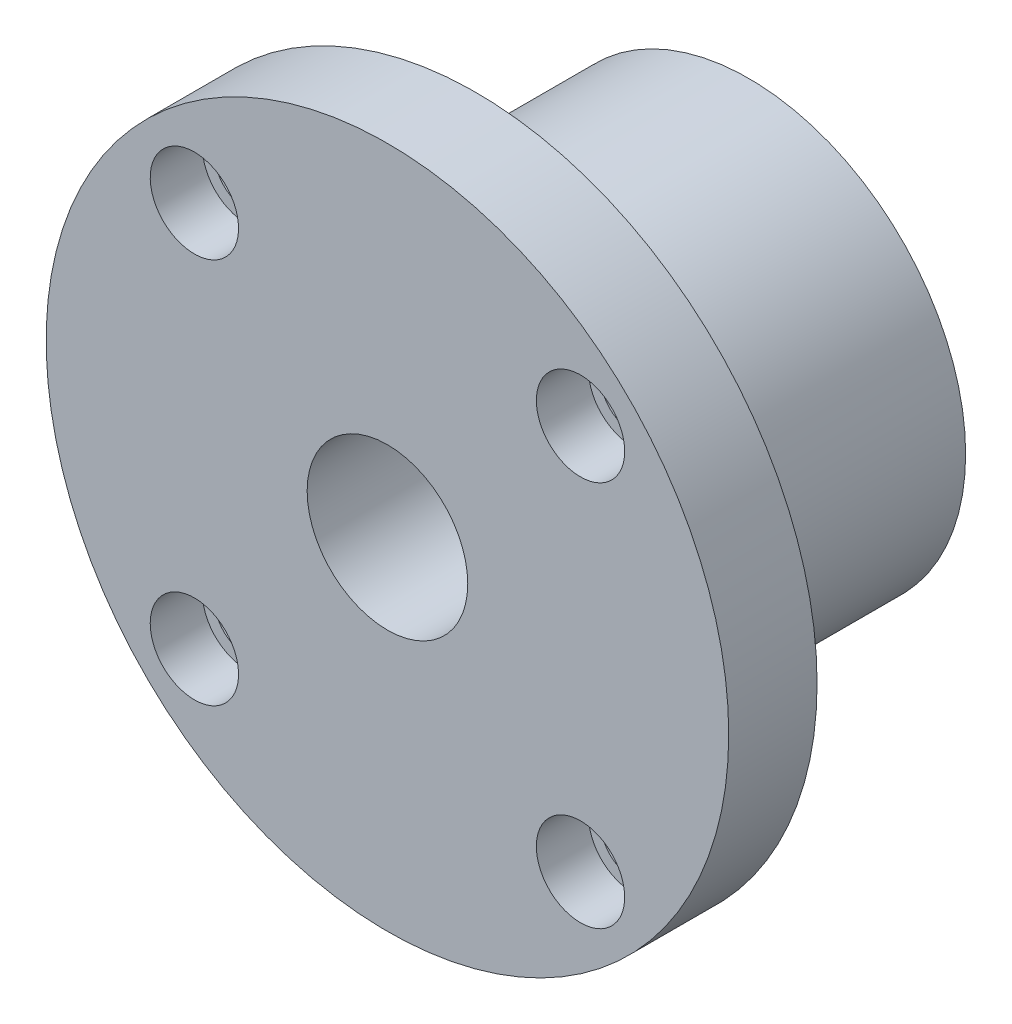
ISO-10303-21;
HEADER;
FILE_DESCRIPTION(('STEP AP214'),'2;1');
FILE_NAME('part.step','',(''),(''),'','','');
FILE_SCHEMA(('AUTOMOTIVE_DESIGN { 1 0 10303 214 1 1 1 1 }'));
ENDSEC;
DATA;
#1=APPLICATION_CONTEXT('core data for automotive mechanical design processes');
#2=APPLICATION_PROTOCOL_DEFINITION('international standard','automotive_design',2000,#1);
#3=PRODUCT_CONTEXT('',#1,'mechanical');
#4=PRODUCT('Part','Part','',(#3));
#5=PRODUCT_RELATED_PRODUCT_CATEGORY('part','',(#4));
#6=PRODUCT_DEFINITION_FORMATION('','',#4);
#7=PRODUCT_DEFINITION_CONTEXT('part definition',#1,'design');
#8=PRODUCT_DEFINITION('design','',#6,#7);
#9=PRODUCT_DEFINITION_SHAPE('','',#8);
#10=(LENGTH_UNIT() NAMED_UNIT(*) SI_UNIT(.MILLI.,.METRE.));
#11=(NAMED_UNIT(*) PLANE_ANGLE_UNIT() SI_UNIT($,.RADIAN.));
#12=(NAMED_UNIT(*) SI_UNIT($,.STERADIAN.) SOLID_ANGLE_UNIT());
#13=UNCERTAINTY_MEASURE_WITH_UNIT(LENGTH_MEASURE(1.E-05),#10,'distance_accuracy_value','');
#14=(GEOMETRIC_REPRESENTATION_CONTEXT(3) GLOBAL_UNCERTAINTY_ASSIGNED_CONTEXT((#13)) GLOBAL_UNIT_ASSIGNED_CONTEXT((#10,
#11,#12)) REPRESENTATION_CONTEXT('',''));
#15=CARTESIAN_POINT('',(0.,0.,0.));
#16=DIRECTION('',(0.,0.,1.));
#17=DIRECTION('',(1.,0.,0.));
#18=AXIS2_PLACEMENT_3D('',#15,#16,#17);
#19=CARTESIAN_POINT('',(0.,0.,0.));
#20=DIRECTION('',(0.,0.,1.));
#21=DIRECTION('',(1.,0.,0.));
#22=AXIS2_PLACEMENT_3D('',#19,#20,#21);
#23=PLANE('',#22);
#24=CARTESIAN_POINT('',(0.,0.,0.));
#25=DIRECTION('',(0.,0.,1.));
#26=DIRECTION('',(1.,0.,0.));
#27=AXIS2_PLACEMENT_3D('',#24,#25,#26);
#28=CIRCLE('',#27,42.5);
#29=CARTESIAN_POINT('',(42.5,0.,0.));
#30=VERTEX_POINT('',#29);
#31=EDGE_CURVE('E23',#30,#30,#28,.T.);
#32=ORIENTED_EDGE('',*,*,#31,.F.);
#33=EDGE_LOOP('',(#32));
#34=FACE_BOUND('',#33,.T.);
#35=CARTESIAN_POINT('',(24.0416305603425,24.0416305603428,0.));
#36=DIRECTION('',(0.,0.,1.));
#37=DIRECTION('',(1.,0.,0.));
#38=AXIS2_PLACEMENT_3D('',#35,#36,#37);
#39=CIRCLE('',#38,4.);
#40=CARTESIAN_POINT('',(28.0416305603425,24.0416305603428,0.));
#41=VERTEX_POINT('',#40);
#42=EDGE_CURVE('E35',#41,#41,#39,.T.);
#43=ORIENTED_EDGE('',*,*,#42,.T.);
#44=EDGE_LOOP('',(#43));
#45=FACE_BOUND('',#44,.T.);
#46=CARTESIAN_POINT('',(24.0416305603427,-24.0416305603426,0.));
#47=DIRECTION('',(0.,0.,1.));
#48=DIRECTION('',(0.,-1.,0.));
#49=AXIS2_PLACEMENT_3D('',#46,#47,#48);
#50=CIRCLE('',#49,4.);
#51=CARTESIAN_POINT('',(24.0416305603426,-28.0416305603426,0.));
#52=VERTEX_POINT('',#51);
#53=EDGE_CURVE('E75',#52,#52,#50,.T.);
#54=ORIENTED_EDGE('',*,*,#53,.T.);
#55=EDGE_LOOP('',(#54));
#56=FACE_BOUND('',#55,.T.);
#57=CARTESIAN_POINT('',(-24.0416305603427,-24.0416305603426,0.));
#58=DIRECTION('',(0.,0.,1.));
#59=DIRECTION('',(-1.,0.,0.));
#60=AXIS2_PLACEMENT_3D('',#57,#58,#59);
#61=CIRCLE('',#60,4.);
#62=CARTESIAN_POINT('',(-28.0416305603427,-24.0416305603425,0.));
#63=VERTEX_POINT('',#62);
#64=EDGE_CURVE('E72',#63,#63,#61,.T.);
#65=ORIENTED_EDGE('',*,*,#64,.T.);
#66=EDGE_LOOP('',(#65));
#67=FACE_BOUND('',#66,.T.);
#68=CARTESIAN_POINT('',(-24.0416305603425,24.0416305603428,0.));
#69=DIRECTION('',(0.,0.,1.));
#70=DIRECTION('',(0.,1.,0.));
#71=AXIS2_PLACEMENT_3D('',#68,#69,#70);
#72=CIRCLE('',#71,4.);
#73=CARTESIAN_POINT('',(-24.0416305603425,28.0416305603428,0.));
#74=VERTEX_POINT('',#73);
#75=EDGE_CURVE('E40',#74,#74,#72,.T.);
#76=ORIENTED_EDGE('',*,*,#75,.T.);
#77=EDGE_LOOP('',(#76));
#78=FACE_BOUND('',#77,.T.);
#79=CARTESIAN_POINT('',(0.,0.,0.));
#80=DIRECTION('',(0.,0.,1.));
#81=DIRECTION('',(1.,0.,0.));
#82=AXIS2_PLACEMENT_3D('',#79,#80,#81);
#83=CIRCLE('',#82,27.);
#84=CARTESIAN_POINT('',(27.,0.,0.));
#85=VERTEX_POINT('',#84);
#86=EDGE_CURVE('E8',#85,#85,#83,.F.);
#87=ORIENTED_EDGE('',*,*,#86,.F.);
#88=EDGE_LOOP('',(#87));
#89=FACE_BOUND('',#88,.T.);
#90=ADVANCED_FACE('F12',(#34,#45,#56,#67,#78,#89),#23,.F.);
#91=CARTESIAN_POINT('',(-24.0416305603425,24.0416305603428,0.));
#92=DIRECTION('',(0.,0.,1.));
#93=DIRECTION('',(1.,0.,0.));
#94=AXIS2_PLACEMENT_3D('',#91,#92,#93);
#95=CYLINDRICAL_SURFACE('',#94,4.);
#96=ORIENTED_EDGE('',*,*,#75,.F.);
#97=EDGE_LOOP('',(#96));
#98=FACE_BOUND('',#97,.T.);
#99=CARTESIAN_POINT('',(-24.0416305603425,24.0416305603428,4.5));
#100=DIRECTION('',(0.,0.,1.));
#101=DIRECTION('',(1.,0.,0.));
#102=AXIS2_PLACEMENT_3D('',#99,#100,#101);
#103=CIRCLE('',#102,4.);
#104=CARTESIAN_POINT('',(-20.0416305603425,24.0416305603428,4.5));
#105=VERTEX_POINT('',#104);
#106=EDGE_CURVE('E46',#105,#105,#103,.F.);
#107=ORIENTED_EDGE('',*,*,#106,.F.);
#108=EDGE_LOOP('',(#107));
#109=FACE_BOUND('',#108,.T.);
#110=ADVANCED_FACE('F120',(#98,#109),#95,.F.);
#111=CARTESIAN_POINT('',(-24.0416305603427,-24.0416305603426,0.));
#112=DIRECTION('',(0.,0.,1.));
#113=DIRECTION('',(1.,0.,0.));
#114=AXIS2_PLACEMENT_3D('',#111,#112,#113);
#115=CYLINDRICAL_SURFACE('',#114,4.);
#116=ORIENTED_EDGE('',*,*,#64,.F.);
#117=EDGE_LOOP('',(#116));
#118=FACE_BOUND('',#117,.T.);
#119=CARTESIAN_POINT('',(-24.0416305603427,-24.0416305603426,4.5));
#120=DIRECTION('',(0.,0.,1.));
#121=DIRECTION('',(1.,0.,0.));
#122=AXIS2_PLACEMENT_3D('',#119,#120,#121);
#123=CIRCLE('',#122,4.);
#124=CARTESIAN_POINT('',(-20.0416305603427,-24.0416305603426,4.5));
#125=VERTEX_POINT('',#124);
#126=EDGE_CURVE('E42',#125,#125,#123,.F.);
#127=ORIENTED_EDGE('',*,*,#126,.F.);
#128=EDGE_LOOP('',(#127));
#129=FACE_BOUND('',#128,.T.);
#130=ADVANCED_FACE('F126',(#118,#129),#115,.F.);
#131=CARTESIAN_POINT('',(24.0416305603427,-24.0416305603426,0.));
#132=DIRECTION('',(0.,0.,1.));
#133=DIRECTION('',(1.,0.,0.));
#134=AXIS2_PLACEMENT_3D('',#131,#132,#133);
#135=CYLINDRICAL_SURFACE('',#134,4.);
#136=ORIENTED_EDGE('',*,*,#53,.F.);
#137=EDGE_LOOP('',(#136));
#138=FACE_BOUND('',#137,.T.);
#139=CARTESIAN_POINT('',(24.0416305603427,-24.0416305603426,4.5));
#140=DIRECTION('',(0.,0.,1.));
#141=DIRECTION('',(1.,0.,0.));
#142=AXIS2_PLACEMENT_3D('',#139,#140,#141);
#143=CIRCLE('',#142,4.);
#144=CARTESIAN_POINT('',(28.0416305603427,-24.0416305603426,4.5));
#145=VERTEX_POINT('',#144);
#146=EDGE_CURVE('E37',#145,#145,#143,.F.);
#147=ORIENTED_EDGE('',*,*,#146,.F.);
#148=EDGE_LOOP('',(#147));
#149=FACE_BOUND('',#148,.T.);
#150=ADVANCED_FACE('F137',(#138,#149),#135,.F.);
#151=CARTESIAN_POINT('',(24.0416305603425,24.0416305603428,0.));
#152=DIRECTION('',(0.,0.,1.));
#153=DIRECTION('',(1.,0.,0.));
#154=AXIS2_PLACEMENT_3D('',#151,#152,#153);
#155=CYLINDRICAL_SURFACE('',#154,4.);
#156=ORIENTED_EDGE('',*,*,#42,.F.);
#157=EDGE_LOOP('',(#156));
#158=FACE_BOUND('',#157,.T.);
#159=CARTESIAN_POINT('',(24.0416305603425,24.0416305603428,4.5));
#160=DIRECTION('',(0.,0.,1.));
#161=DIRECTION('',(1.,0.,0.));
#162=AXIS2_PLACEMENT_3D('',#159,#160,#161);
#163=CIRCLE('',#162,4.);
#164=CARTESIAN_POINT('',(28.0416305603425,24.0416305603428,4.5));
#165=VERTEX_POINT('',#164);
#166=EDGE_CURVE('E32',#165,#165,#163,.F.);
#167=ORIENTED_EDGE('',*,*,#166,.F.);
#168=EDGE_LOOP('',(#167));
#169=FACE_BOUND('',#168,.T.);
#170=ADVANCED_FACE('F92',(#158,#169),#155,.F.);
#171=CARTESIAN_POINT('',(0.,0.,11.));
#172=DIRECTION('',(0.,0.,1.));
#173=DIRECTION('',(1.,0.,0.));
#174=AXIS2_PLACEMENT_3D('',#171,#172,#173);
#175=PLANE('',#174);
#176=CARTESIAN_POINT('',(0.,0.,11.));
#177=DIRECTION('',(0.,0.,1.));
#178=DIRECTION('',(1.,0.,0.));
#179=AXIS2_PLACEMENT_3D('',#176,#177,#178);
#180=CIRCLE('',#179,10.);
#181=CARTESIAN_POINT('',(10.,0.,11.));
#182=VERTEX_POINT('',#181);
#183=EDGE_CURVE('E28',#182,#182,#180,.T.);
#184=ORIENTED_EDGE('',*,*,#183,.F.);
#185=EDGE_LOOP('',(#184));
#186=FACE_BOUND('',#185,.T.);
#187=CARTESIAN_POINT('',(0.,0.,11.));
#188=DIRECTION('',(0.,0.,1.));
#189=DIRECTION('',(1.,0.,0.));
#190=AXIS2_PLACEMENT_3D('',#187,#188,#189);
#191=CIRCLE('',#190,42.5);
#192=CARTESIAN_POINT('',(42.5,0.,11.));
#193=VERTEX_POINT('',#192);
#194=EDGE_CURVE('E19',#193,#193,#191,.T.);
#195=ORIENTED_EDGE('',*,*,#194,.T.);
#196=EDGE_LOOP('',(#195));
#197=FACE_BOUND('',#196,.T.);
#198=CARTESIAN_POINT('',(24.0416305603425,24.0416305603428,11.));
#199=DIRECTION('',(0.,0.,1.));
#200=DIRECTION('',(1.,0.,0.));
#201=AXIS2_PLACEMENT_3D('',#198,#199,#200);
#202=CIRCLE('',#201,5.5);
#203=CARTESIAN_POINT('',(29.5416305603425,24.0416305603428,11.));
#204=VERTEX_POINT('',#203);
#205=EDGE_CURVE('E78',#204,#204,#202,.T.);
#206=ORIENTED_EDGE('',*,*,#205,.F.);
#207=EDGE_LOOP('',(#206));
#208=FACE_BOUND('',#207,.T.);
#209=CARTESIAN_POINT('',(24.0416305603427,-24.0416305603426,11.));
#210=DIRECTION('',(0.,0.,1.));
#211=DIRECTION('',(0.,-1.,0.));
#212=AXIS2_PLACEMENT_3D('',#209,#210,#211);
#213=CIRCLE('',#212,5.5);
#214=CARTESIAN_POINT('',(24.0416305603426,-29.5416305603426,11.));
#215=VERTEX_POINT('',#214);
#216=EDGE_CURVE('E44',#215,#215,#213,.T.);
#217=ORIENTED_EDGE('',*,*,#216,.F.);
#218=EDGE_LOOP('',(#217));
#219=FACE_BOUND('',#218,.T.);
#220=CARTESIAN_POINT('',(-24.0416305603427,-24.0416305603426,11.));
#221=DIRECTION('',(0.,0.,1.));
#222=DIRECTION('',(-1.,0.,0.));
#223=AXIS2_PLACEMENT_3D('',#220,#221,#222);
#224=CIRCLE('',#223,5.5);
#225=CARTESIAN_POINT('',(-29.5416305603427,-24.0416305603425,11.));
#226=VERTEX_POINT('',#225);
#227=EDGE_CURVE('E48',#226,#226,#224,.T.);
#228=ORIENTED_EDGE('',*,*,#227,.F.);
#229=EDGE_LOOP('',(#228));
#230=FACE_BOUND('',#229,.T.);
#231=CARTESIAN_POINT('',(-24.0416305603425,24.0416305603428,11.));
#232=DIRECTION('',(0.,0.,1.));
#233=DIRECTION('',(0.,1.,0.));
#234=AXIS2_PLACEMENT_3D('',#231,#232,#233);
#235=CIRCLE('',#234,5.5);
#236=CARTESIAN_POINT('',(-24.0416305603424,29.5416305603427,11.));
#237=VERTEX_POINT('',#236);
#238=EDGE_CURVE('E55',#237,#237,#235,.T.);
#239=ORIENTED_EDGE('',*,*,#238,.F.);
#240=EDGE_LOOP('',(#239));
#241=FACE_BOUND('',#240,.T.);
#242=ADVANCED_FACE('F90',(#186,#197,#208,#219,#230,#241),#175,.T.);
#243=CARTESIAN_POINT('',(0.,0.,11.));
#244=DIRECTION('',(0.,0.,-1.));
#245=DIRECTION('',(-1.,0.,0.));
#246=AXIS2_PLACEMENT_3D('',#243,#244,#245);
#247=CYLINDRICAL_SURFACE('',#246,42.5);
#248=ORIENTED_EDGE('',*,*,#194,.F.);
#249=EDGE_LOOP('',(#248));
#250=FACE_BOUND('',#249,.T.);
#251=ORIENTED_EDGE('',*,*,#31,.T.);
#252=EDGE_LOOP('',(#251));
#253=FACE_BOUND('',#252,.T.);
#254=ADVANCED_FACE('F14',(#250,#253),#247,.T.);
#255=CARTESIAN_POINT('',(0.,0.,11.));
#256=DIRECTION('',(0.,0.,-1.));
#257=DIRECTION('',(-1.,0.,0.));
#258=AXIS2_PLACEMENT_3D('',#255,#256,#257);
#259=CYLINDRICAL_SURFACE('',#258,10.);
#260=ORIENTED_EDGE('',*,*,#183,.T.);
#261=EDGE_LOOP('',(#260));
#262=FACE_BOUND('',#261,.T.);
#263=CARTESIAN_POINT('',(0.,0.,-34.));
#264=DIRECTION('',(0.,0.,-1.));
#265=DIRECTION('',(-1.,0.,0.));
#266=AXIS2_PLACEMENT_3D('',#263,#264,#265);
#267=CIRCLE('',#266,10.);
#268=CARTESIAN_POINT('',(-10.,0.,-34.));
#269=VERTEX_POINT('',#268);
#270=EDGE_CURVE('E292',#269,#269,#267,.T.);
#271=ORIENTED_EDGE('',*,*,#270,.T.);
#272=EDGE_LOOP('',(#271));
#273=FACE_BOUND('',#272,.T.);
#274=ADVANCED_FACE('F87',(#262,#273),#259,.F.);
#275=CARTESIAN_POINT('',(24.0416305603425,24.0416305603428,4.5));
#276=DIRECTION('',(0.,0.,1.));
#277=DIRECTION('',(1.,0.,0.));
#278=AXIS2_PLACEMENT_3D('',#275,#276,#277);
#279=PLANE('',#278);
#280=CARTESIAN_POINT('',(24.0416305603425,24.0416305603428,4.5));
#281=DIRECTION('',(0.,0.,1.));
#282=DIRECTION('',(1.,0.,0.));
#283=AXIS2_PLACEMENT_3D('',#280,#281,#282);
#284=CIRCLE('',#283,5.5);
#285=CARTESIAN_POINT('',(29.5416305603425,24.0416305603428,4.5));
#286=VERTEX_POINT('',#285);
#287=EDGE_CURVE('E36',#286,#286,#284,.T.);
#288=ORIENTED_EDGE('',*,*,#287,.T.);
#289=EDGE_LOOP('',(#288));
#290=FACE_BOUND('',#289,.T.);
#291=ORIENTED_EDGE('',*,*,#166,.T.);
#292=EDGE_LOOP('',(#291));
#293=FACE_BOUND('',#292,.T.);
#294=ADVANCED_FACE('F134',(#290,#293),#279,.T.);
#295=CARTESIAN_POINT('',(24.0416305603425,24.0416305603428,4.5));
#296=DIRECTION('',(0.,0.,1.));
#297=DIRECTION('',(1.,0.,0.));
#298=AXIS2_PLACEMENT_3D('',#295,#296,#297);
#299=CYLINDRICAL_SURFACE('',#298,5.5);
#300=ORIENTED_EDGE('',*,*,#287,.F.);
#301=EDGE_LOOP('',(#300));
#302=FACE_BOUND('',#301,.T.);
#303=ORIENTED_EDGE('',*,*,#205,.T.);
#304=EDGE_LOOP('',(#303));
#305=FACE_BOUND('',#304,.T.);
#306=ADVANCED_FACE('F139',(#302,#305),#299,.F.);
#307=CARTESIAN_POINT('',(24.0416305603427,-24.0416305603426,4.5));
#308=DIRECTION('',(0.,0.,1.));
#309=DIRECTION('',(0.,-1.,0.));
#310=AXIS2_PLACEMENT_3D('',#307,#308,#309);
#311=PLANE('',#310);
#312=CARTESIAN_POINT('',(24.0416305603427,-24.0416305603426,4.5));
#313=DIRECTION('',(0.,0.,1.));
#314=DIRECTION('',(0.,-1.,0.));
#315=AXIS2_PLACEMENT_3D('',#312,#313,#314);
#316=CIRCLE('',#315,5.5);
#317=CARTESIAN_POINT('',(24.0416305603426,-29.5416305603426,4.5));
#318=VERTEX_POINT('',#317);
#319=EDGE_CURVE('E41',#318,#318,#316,.T.);
#320=ORIENTED_EDGE('',*,*,#319,.T.);
#321=EDGE_LOOP('',(#320));
#322=FACE_BOUND('',#321,.T.);
#323=ORIENTED_EDGE('',*,*,#146,.T.);
#324=EDGE_LOOP('',(#323));
#325=FACE_BOUND('',#324,.T.);
#326=ADVANCED_FACE('F142',(#322,#325),#311,.T.);
#327=CARTESIAN_POINT('',(24.0416305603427,-24.0416305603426,4.5));
#328=DIRECTION('',(0.,0.,1.));
#329=DIRECTION('',(1.,0.,0.));
#330=AXIS2_PLACEMENT_3D('',#327,#328,#329);
#331=CYLINDRICAL_SURFACE('',#330,5.5);
#332=ORIENTED_EDGE('',*,*,#319,.F.);
#333=EDGE_LOOP('',(#332));
#334=FACE_BOUND('',#333,.T.);
#335=ORIENTED_EDGE('',*,*,#216,.T.);
#336=EDGE_LOOP('',(#335));
#337=FACE_BOUND('',#336,.T.);
#338=ADVANCED_FACE('F153',(#334,#337),#331,.F.);
#339=CARTESIAN_POINT('',(-24.0416305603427,-24.0416305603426,4.5));
#340=DIRECTION('',(0.,0.,1.));
#341=DIRECTION('',(-1.,0.,0.));
#342=AXIS2_PLACEMENT_3D('',#339,#340,#341);
#343=PLANE('',#342);
#344=CARTESIAN_POINT('',(-24.0416305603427,-24.0416305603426,4.5));
#345=DIRECTION('',(0.,0.,1.));
#346=DIRECTION('',(-1.,0.,0.));
#347=AXIS2_PLACEMENT_3D('',#344,#345,#346);
#348=CIRCLE('',#347,5.5);
#349=CARTESIAN_POINT('',(-29.5416305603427,-24.0416305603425,4.5));
#350=VERTEX_POINT('',#349);
#351=EDGE_CURVE('E45',#350,#350,#348,.T.);
#352=ORIENTED_EDGE('',*,*,#351,.T.);
#353=EDGE_LOOP('',(#352));
#354=FACE_BOUND('',#353,.T.);
#355=ORIENTED_EDGE('',*,*,#126,.T.);
#356=EDGE_LOOP('',(#355));
#357=FACE_BOUND('',#356,.T.);
#358=ADVANCED_FACE('F156',(#354,#357),#343,.T.);
#359=CARTESIAN_POINT('',(-24.0416305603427,-24.0416305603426,4.5));
#360=DIRECTION('',(0.,0.,1.));
#361=DIRECTION('',(1.,0.,0.));
#362=AXIS2_PLACEMENT_3D('',#359,#360,#361);
#363=CYLINDRICAL_SURFACE('',#362,5.5);
#364=ORIENTED_EDGE('',*,*,#351,.F.);
#365=EDGE_LOOP('',(#364));
#366=FACE_BOUND('',#365,.T.);
#367=ORIENTED_EDGE('',*,*,#227,.T.);
#368=EDGE_LOOP('',(#367));
#369=FACE_BOUND('',#368,.T.);
#370=ADVANCED_FACE('F116',(#366,#369),#363,.F.);
#371=CARTESIAN_POINT('',(-24.0416305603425,24.0416305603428,4.5));
#372=DIRECTION('',(0.,0.,1.));
#373=DIRECTION('',(0.,1.,0.));
#374=AXIS2_PLACEMENT_3D('',#371,#372,#373);
#375=PLANE('',#374);
#376=CARTESIAN_POINT('',(-24.0416305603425,24.0416305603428,4.5));
#377=DIRECTION('',(0.,0.,1.));
#378=DIRECTION('',(0.,1.,0.));
#379=AXIS2_PLACEMENT_3D('',#376,#377,#378);
#380=CIRCLE('',#379,5.5);
#381=CARTESIAN_POINT('',(-24.0416305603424,29.5416305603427,4.5));
#382=VERTEX_POINT('',#381);
#383=EDGE_CURVE('E49',#382,#382,#380,.T.);
#384=ORIENTED_EDGE('',*,*,#383,.T.);
#385=EDGE_LOOP('',(#384));
#386=FACE_BOUND('',#385,.T.);
#387=ORIENTED_EDGE('',*,*,#106,.T.);
#388=EDGE_LOOP('',(#387));
#389=FACE_BOUND('',#388,.T.);
#390=ADVANCED_FACE('F105',(#386,#389),#375,.T.);
#391=CARTESIAN_POINT('',(-24.0416305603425,24.0416305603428,4.5));
#392=DIRECTION('',(0.,0.,1.));
#393=DIRECTION('',(1.,0.,0.));
#394=AXIS2_PLACEMENT_3D('',#391,#392,#393);
#395=CYLINDRICAL_SURFACE('',#394,5.5);
#396=ORIENTED_EDGE('',*,*,#383,.F.);
#397=EDGE_LOOP('',(#396));
#398=FACE_BOUND('',#397,.T.);
#399=ORIENTED_EDGE('',*,*,#238,.T.);
#400=EDGE_LOOP('',(#399));
#401=FACE_BOUND('',#400,.T.);
#402=ADVANCED_FACE('F102',(#398,#401),#395,.F.);
#403=CARTESIAN_POINT('',(0.,0.,-34.));
#404=DIRECTION('',(0.,0.,1.));
#405=DIRECTION('',(1.,0.,0.));
#406=AXIS2_PLACEMENT_3D('',#403,#404,#405);
#407=CYLINDRICAL_SURFACE('',#406,27.);
#408=CARTESIAN_POINT('',(0.,0.,-34.));
#409=DIRECTION('',(0.,0.,-1.));
#410=DIRECTION('',(-1.,0.,0.));
#411=AXIS2_PLACEMENT_3D('',#408,#409,#410);
#412=CIRCLE('',#411,27.);
#413=CARTESIAN_POINT('',(-27.,0.,-34.));
#414=VERTEX_POINT('',#413);
#415=EDGE_CURVE('E60',#414,#414,#412,.T.);
#416=ORIENTED_EDGE('',*,*,#415,.F.);
#417=EDGE_LOOP('',(#416));
#418=FACE_BOUND('',#417,.T.);
#419=ORIENTED_EDGE('',*,*,#86,.T.);
#420=EDGE_LOOP('',(#419));
#421=FACE_BOUND('',#420,.T.);
#422=ADVANCED_FACE('F104',(#418,#421),#407,.T.);
#423=CARTESIAN_POINT('',(0.,0.,-34.));
#424=DIRECTION('',(0.,0.,-1.));
#425=DIRECTION('',(-1.,0.,0.));
#426=AXIS2_PLACEMENT_3D('',#423,#424,#425);
#427=PLANE('',#426);
#428=ORIENTED_EDGE('',*,*,#415,.T.);
#429=EDGE_LOOP('',(#428));
#430=FACE_BOUND('',#429,.T.);
#431=ORIENTED_EDGE('',*,*,#270,.F.);
#432=EDGE_LOOP('',(#431));
#433=FACE_BOUND('',#432,.T.);
#434=ADVANCED_FACE('F113',(#430,#433),#427,.T.);
#435=CLOSED_SHELL('',(#90,#110,#130,#150,#170,#242,#254,#274,#294,#306,#326,#338,#358,#370,#390,
#402,#422,#434));
#436=MANIFOLD_SOLID_BREP('B1',#435);
#437=ADVANCED_BREP_SHAPE_REPRESENTATION('',(#18,#436),#14);
#438=SHAPE_DEFINITION_REPRESENTATION(#9,#437);
ENDSEC;
END-ISO-10303-21;
